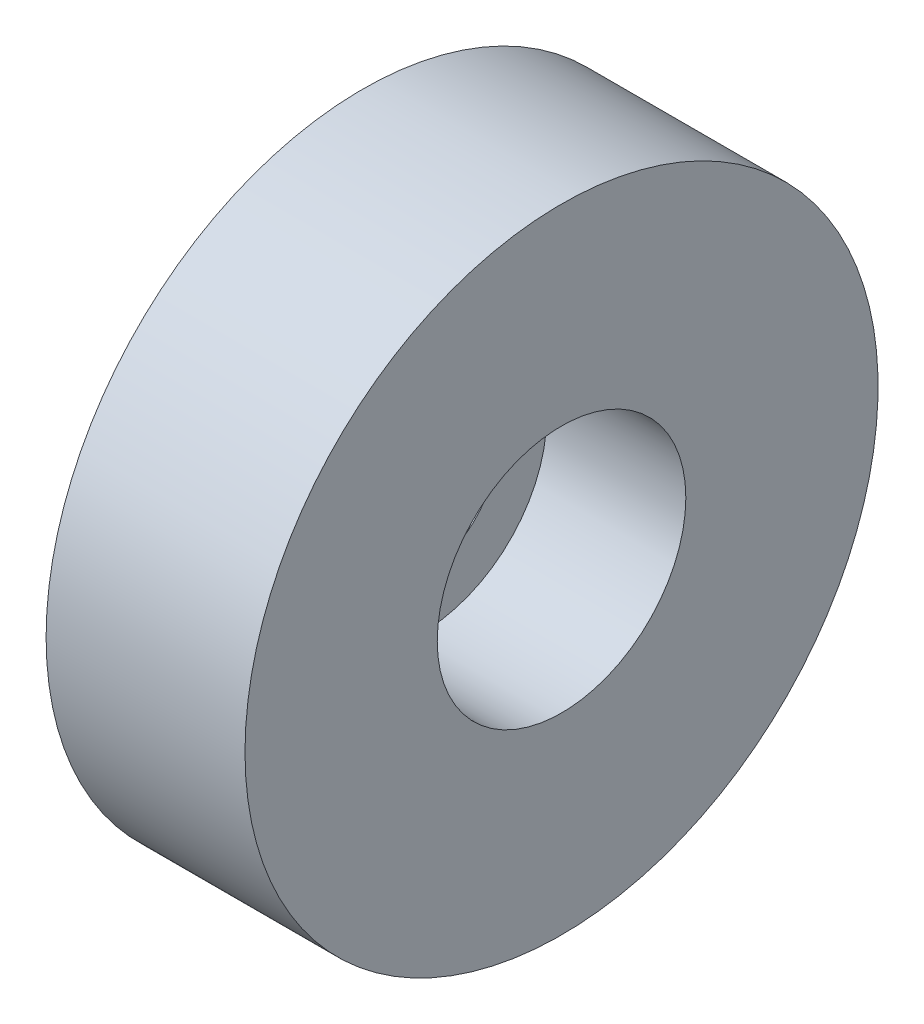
ISO-10303-21;
HEADER;
FILE_DESCRIPTION(('STEP AP214'),'2;1');
FILE_NAME('part.step','',(''),(''),'','','');
FILE_SCHEMA(('AUTOMOTIVE_DESIGN { 1 0 10303 214 1 1 1 1 }'));
ENDSEC;
DATA;
#1=APPLICATION_CONTEXT('core data for automotive mechanical design processes');
#2=APPLICATION_PROTOCOL_DEFINITION('international standard','automotive_design',2000,#1);
#3=PRODUCT_CONTEXT('',#1,'mechanical');
#4=PRODUCT('Part','Part','',(#3));
#5=PRODUCT_RELATED_PRODUCT_CATEGORY('part','',(#4));
#6=PRODUCT_DEFINITION_FORMATION('','',#4);
#7=PRODUCT_DEFINITION_CONTEXT('part definition',#1,'design');
#8=PRODUCT_DEFINITION('design','',#6,#7);
#9=PRODUCT_DEFINITION_SHAPE('','',#8);
#10=(LENGTH_UNIT() NAMED_UNIT(*) SI_UNIT(.MILLI.,.METRE.));
#11=(NAMED_UNIT(*) PLANE_ANGLE_UNIT() SI_UNIT($,.RADIAN.));
#12=(NAMED_UNIT(*) SI_UNIT($,.STERADIAN.) SOLID_ANGLE_UNIT());
#13=UNCERTAINTY_MEASURE_WITH_UNIT(LENGTH_MEASURE(1.E-05),#10,'distance_accuracy_value','');
#14=(GEOMETRIC_REPRESENTATION_CONTEXT(3) GLOBAL_UNCERTAINTY_ASSIGNED_CONTEXT((#13)) GLOBAL_UNIT_ASSIGNED_CONTEXT((#10,
#11,#12)) REPRESENTATION_CONTEXT('',''));
#15=CARTESIAN_POINT('',(0.,0.,0.));
#16=DIRECTION('',(0.,0.,1.));
#17=DIRECTION('',(1.,0.,0.));
#18=AXIS2_PLACEMENT_3D('',#15,#16,#17);
#19=CARTESIAN_POINT('',(60.,8.00000000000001,0.));
#20=DIRECTION('',(-1.,0.,0.));
#21=DIRECTION('',(0.,0.,1.));
#22=AXIS2_PLACEMENT_3D('',#19,#20,#21);
#23=PLANE('',#22);
#24=CARTESIAN_POINT('',(60.,0.,0.));
#25=DIRECTION('',(-1.,0.,0.));
#26=DIRECTION('',(0.,0.,1.));
#27=AXIS2_PLACEMENT_3D('',#24,#25,#26);
#28=CIRCLE('',#27,95.4929658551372);
#29=CARTESIAN_POINT('',(60.,0.,95.4929658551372));
#30=VERTEX_POINT('',#29);
#31=EDGE_CURVE('E456',#30,#30,#28,.T.);
#32=ORIENTED_EDGE('',*,*,#31,.F.);
#33=EDGE_LOOP('',(#32));
#34=FACE_BOUND('',#33,.T.);
#35=CARTESIAN_POINT('',(60.,0.,0.));
#36=DIRECTION('',(-1.,0.,0.));
#37=DIRECTION('',(0.,0.,1.));
#38=AXIS2_PLACEMENT_3D('',#35,#36,#37);
#39=CIRCLE('',#38,37.5);
#40=CARTESIAN_POINT('',(60.,0.,-37.5));
#41=VERTEX_POINT('',#40);
#42=EDGE_CURVE('E468',#41,#41,#39,.T.);
#43=ORIENTED_EDGE('',*,*,#42,.T.);
#44=EDGE_LOOP('',(#43));
#45=FACE_BOUND('',#44,.T.);
#46=ADVANCED_FACE('F448',(#34,#45),#23,.F.);
#47=CARTESIAN_POINT('',(-89.8058817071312,0.,0.));
#48=DIRECTION('',(-1.,0.,0.));
#49=DIRECTION('',(0.,0.,1.));
#50=AXIS2_PLACEMENT_3D('',#47,#48,#49);
#51=CYLINDRICAL_SURFACE('',#50,95.4929658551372);
#52=CARTESIAN_POINT('',(0.,0.,0.));
#53=DIRECTION('',(-1.,0.,0.));
#54=DIRECTION('',(0.,0.,1.));
#55=AXIS2_PLACEMENT_3D('',#52,#53,#54);
#56=CIRCLE('',#55,95.4929658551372);
#57=CARTESIAN_POINT('',(0.,0.,95.4929658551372));
#58=VERTEX_POINT('',#57);
#59=EDGE_CURVE('E10',#58,#58,#56,.T.);
#60=ORIENTED_EDGE('',*,*,#59,.F.);
#61=EDGE_LOOP('',(#60));
#62=FACE_BOUND('',#61,.T.);
#63=ORIENTED_EDGE('',*,*,#31,.T.);
#64=EDGE_LOOP('',(#63));
#65=FACE_BOUND('',#64,.T.);
#66=ADVANCED_FACE('F450',(#62,#65),#51,.T.);
#67=CARTESIAN_POINT('',(0.,95.4929658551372,0.));
#68=DIRECTION('',(1.,0.,0.));
#69=DIRECTION('',(0.,0.,-1.));
#70=AXIS2_PLACEMENT_3D('',#67,#68,#69);
#71=PLANE('',#70);
#72=CARTESIAN_POINT('',(0.,0.,0.));
#73=DIRECTION('',(-1.,0.,0.));
#74=DIRECTION('',(0.,0.,1.));
#75=AXIS2_PLACEMENT_3D('',#72,#73,#74);
#76=CIRCLE('',#75,22.5);
#77=CARTESIAN_POINT('',(0.,0.,22.5));
#78=VERTEX_POINT('',#77);
#79=EDGE_CURVE('E460',#78,#78,#76,.T.);
#80=ORIENTED_EDGE('',*,*,#79,.F.);
#81=EDGE_LOOP('',(#80));
#82=FACE_BOUND('',#81,.T.);
#83=ORIENTED_EDGE('',*,*,#59,.T.);
#84=EDGE_LOOP('',(#83));
#85=FACE_BOUND('',#84,.T.);
#86=ADVANCED_FACE('F491',(#82,#85),#71,.F.);
#87=CARTESIAN_POINT('',(60.,0.,0.));
#88=DIRECTION('',(-1.,0.,0.));
#89=DIRECTION('',(0.,0.,1.));
#90=AXIS2_PLACEMENT_3D('',#87,#88,#89);
#91=CYLINDRICAL_SURFACE('',#90,22.5);
#92=CARTESIAN_POINT('',(18.,0.,0.));
#93=DIRECTION('',(-1.,0.,0.));
#94=DIRECTION('',(0.,0.,1.));
#95=AXIS2_PLACEMENT_3D('',#92,#93,#94);
#96=CIRCLE('',#95,22.5);
#97=CARTESIAN_POINT('',(18.,0.,22.5));
#98=VERTEX_POINT('',#97);
#99=EDGE_CURVE('E452',#98,#98,#96,.F.);
#100=ORIENTED_EDGE('',*,*,#99,.T.);
#101=EDGE_LOOP('',(#100));
#102=FACE_BOUND('',#101,.T.);
#103=ORIENTED_EDGE('',*,*,#79,.T.);
#104=EDGE_LOOP('',(#103));
#105=FACE_BOUND('',#104,.T.);
#106=ADVANCED_FACE('F481',(#102,#105),#91,.F.);
#107=CARTESIAN_POINT('',(18.,0.,0.));
#108=DIRECTION('',(-1.,0.,0.));
#109=DIRECTION('',(0.,0.,1.));
#110=AXIS2_PLACEMENT_3D('',#107,#108,#109);
#111=PLANE('',#110);
#112=CARTESIAN_POINT('',(18.,0.,0.));
#113=DIRECTION('',(-1.,0.,0.));
#114=DIRECTION('',(0.,0.,1.));
#115=AXIS2_PLACEMENT_3D('',#112,#113,#114);
#116=CIRCLE('',#115,37.5);
#117=CARTESIAN_POINT('',(18.,0.,-37.5));
#118=VERTEX_POINT('',#117);
#119=EDGE_CURVE('E465',#118,#118,#116,.T.);
#120=ORIENTED_EDGE('',*,*,#119,.F.);
#121=EDGE_LOOP('',(#120));
#122=FACE_BOUND('',#121,.T.);
#123=ORIENTED_EDGE('',*,*,#99,.F.);
#124=EDGE_LOOP('',(#123));
#125=FACE_BOUND('',#124,.T.);
#126=ADVANCED_FACE('F475',(#122,#125),#111,.F.);
#127=CARTESIAN_POINT('',(18.,0.,0.));
#128=DIRECTION('',(1.,0.,0.));
#129=DIRECTION('',(0.,0.,-1.));
#130=AXIS2_PLACEMENT_3D('',#127,#128,#129);
#131=CYLINDRICAL_SURFACE('',#130,37.5);
#132=CARTESIAN_POINT('',(18.,0.,-37.5));
#133=CARTESIAN_POINT('',(18.4375,0.,-37.5));
#134=CARTESIAN_POINT('',(18.875,0.,-37.5));
#135=CARTESIAN_POINT('',(19.75,0.,-37.5));
#136=CARTESIAN_POINT('',(20.1875,0.,-37.5));
#137=CARTESIAN_POINT('',(21.0625,0.,-37.5));
#138=CARTESIAN_POINT('',(21.5,0.,-37.5));
#139=CARTESIAN_POINT('',(22.375,0.,-37.5));
#140=CARTESIAN_POINT('',(22.8125,0.,-37.5));
#141=CARTESIAN_POINT('',(23.6875,0.,-37.5));
#142=CARTESIAN_POINT('',(24.125,0.,-37.5));
#143=CARTESIAN_POINT('',(25.,0.,-37.5));
#144=CARTESIAN_POINT('',(25.4375,0.,-37.5));
#145=CARTESIAN_POINT('',(26.3125,0.,-37.5));
#146=CARTESIAN_POINT('',(26.75,0.,-37.5));
#147=CARTESIAN_POINT('',(27.625,0.,-37.5));
#148=CARTESIAN_POINT('',(28.0625,0.,-37.5));
#149=CARTESIAN_POINT('',(28.9375,0.,-37.5));
#150=CARTESIAN_POINT('',(29.375,0.,-37.5));
#151=CARTESIAN_POINT('',(30.25,0.,-37.5));
#152=CARTESIAN_POINT('',(30.6875,0.,-37.5));
#153=CARTESIAN_POINT('',(31.5625,0.,-37.5));
#154=CARTESIAN_POINT('',(32.,0.,-37.5));
#155=CARTESIAN_POINT('',(32.875,0.,-37.5));
#156=CARTESIAN_POINT('',(33.3125,0.,-37.5));
#157=CARTESIAN_POINT('',(34.1875,0.,-37.5));
#158=CARTESIAN_POINT('',(34.625,0.,-37.5));
#159=CARTESIAN_POINT('',(35.5,0.,-37.5));
#160=CARTESIAN_POINT('',(35.9375,0.,-37.5));
#161=CARTESIAN_POINT('',(36.8125,0.,-37.5));
#162=CARTESIAN_POINT('',(37.25,0.,-37.5));
#163=CARTESIAN_POINT('',(38.125,0.,-37.5));
#164=CARTESIAN_POINT('',(38.5625,0.,-37.5));
#165=CARTESIAN_POINT('',(39.4375,0.,-37.5));
#166=CARTESIAN_POINT('',(39.875,0.,-37.5));
#167=CARTESIAN_POINT('',(40.75,0.,-37.5));
#168=CARTESIAN_POINT('',(41.1875,0.,-37.5));
#169=CARTESIAN_POINT('',(42.0625,0.,-37.5));
#170=CARTESIAN_POINT('',(42.5,0.,-37.5));
#171=CARTESIAN_POINT('',(43.375,0.,-37.5));
#172=CARTESIAN_POINT('',(43.8125,0.,-37.5));
#173=CARTESIAN_POINT('',(44.6875,0.,-37.5));
#174=CARTESIAN_POINT('',(45.125,0.,-37.5));
#175=CARTESIAN_POINT('',(46.,0.,-37.5));
#176=CARTESIAN_POINT('',(46.4375,0.,-37.5));
#177=CARTESIAN_POINT('',(47.3125,0.,-37.5));
#178=CARTESIAN_POINT('',(47.75,0.,-37.5));
#179=CARTESIAN_POINT('',(48.625,0.,-37.5));
#180=CARTESIAN_POINT('',(49.0625,0.,-37.5));
#181=CARTESIAN_POINT('',(49.9375,0.,-37.5));
#182=CARTESIAN_POINT('',(50.375,0.,-37.5));
#183=CARTESIAN_POINT('',(51.25,0.,-37.5));
#184=CARTESIAN_POINT('',(51.6875,0.,-37.5));
#185=CARTESIAN_POINT('',(52.5625,0.,-37.5));
#186=CARTESIAN_POINT('',(53.,0.,-37.5));
#187=CARTESIAN_POINT('',(53.875,0.,-37.5));
#188=CARTESIAN_POINT('',(54.3125,0.,-37.5));
#189=CARTESIAN_POINT('',(55.1875,0.,-37.5));
#190=CARTESIAN_POINT('',(55.625,0.,-37.5));
#191=CARTESIAN_POINT('',(56.5,0.,-37.5));
#192=CARTESIAN_POINT('',(56.9375,0.,-37.5));
#193=CARTESIAN_POINT('',(57.8125,0.,-37.5));
#194=CARTESIAN_POINT('',(58.25,0.,-37.5));
#195=CARTESIAN_POINT('',(59.125,0.,-37.5));
#196=CARTESIAN_POINT('',(59.5625,0.,-37.5));
#197=CARTESIAN_POINT('',(60.,0.,-37.5));
#198=B_SPLINE_CURVE_WITH_KNOTS('',3,(#132,#133,#134,#135,#136,#137,#138,#139,#140,#141,#142,
#143,#144,#145,#146,#147,#148,#149,#150,#151,#152,#153,#154,#155,#156,#157,#158,#159,#160,#161,
#162,#163,#164,#165,#166,#167,#168,#169,#170,#171,#172,#173,#174,#175,#176,#177,#178,#179,#180,
#181,#182,#183,#184,#185,#186,#187,#188,#189,#190,#191,#192,#193,#194,#195,#196,#197),
.UNSPECIFIED.,.F.,.F.,(4,2,2,2,2,2,2,2,2,2,2,2,2,2,2,2,2,2,2,2,2,2,2,2,2,2,2,2,2,2,2,2,4),(0.,
1.3125,2.625,3.9375,5.25,6.5625,7.875,9.1875,10.5,11.8125,13.125,14.4375,15.75,17.0625,18.375,
19.6875,21.,22.3125,23.625,24.9375,26.25,27.5625,28.875,30.1875,31.5,32.8125,34.125,35.4375,
36.75,38.0625,39.375,40.6875,42.),.UNSPECIFIED.);
#199=EDGE_CURVE('BSEAM473',#118,#41,#198,.T.);
#200=ORIENTED_EDGE('',*,*,#119,.T.);
#201=ORIENTED_EDGE('',*,*,#42,.F.);
#202=ORIENTED_EDGE('',*,*,#199,.T.);
#203=ORIENTED_EDGE('',*,*,#199,.F.);
#204=EDGE_LOOP('',(#200,#202,#201,#203));
#205=FACE_BOUND('',#204,.T.);
#206=ADVANCED_FACE('F473',(#205),#131,.F.);
#207=CLOSED_SHELL('',(#46,#66,#86,#106,#126,#206));
#208=MANIFOLD_SOLID_BREP('B2',#207);
#209=ADVANCED_BREP_SHAPE_REPRESENTATION('',(#18,#208),#14);
#210=SHAPE_DEFINITION_REPRESENTATION(#9,#209);
ENDSEC;
END-ISO-10303-21;
